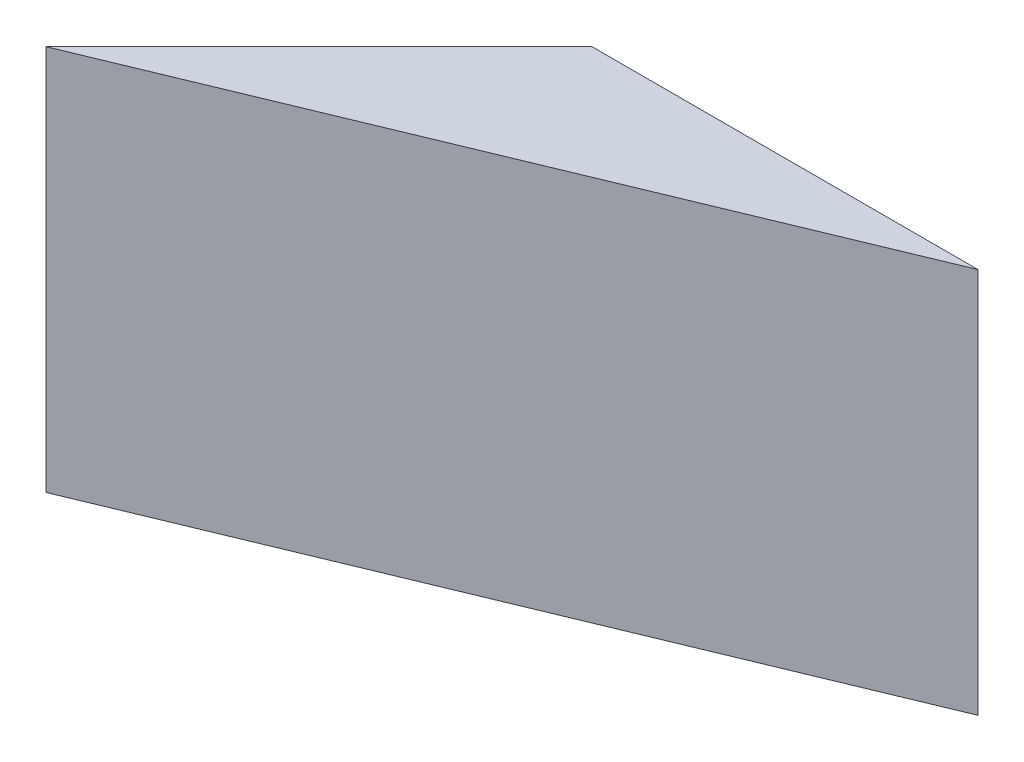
from build123d import *

# Parameters (mm, degrees)
EXTRUDE_1_DEPTH = 60


with BuildPart() as part:
    # Sketch 1 → Extrude 1 (new body)
    with BuildSketch(Plane(origin=(0, 0, 0), x_dir=(1, 0, 0), z_dir=(0, 1, 0))):
        Polygon((0, 0), (60, 0), (-42.426406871, -42.426406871), align=None)
    extrude(amount=EXTRUDE_1_DEPTH)


solid = part.part
